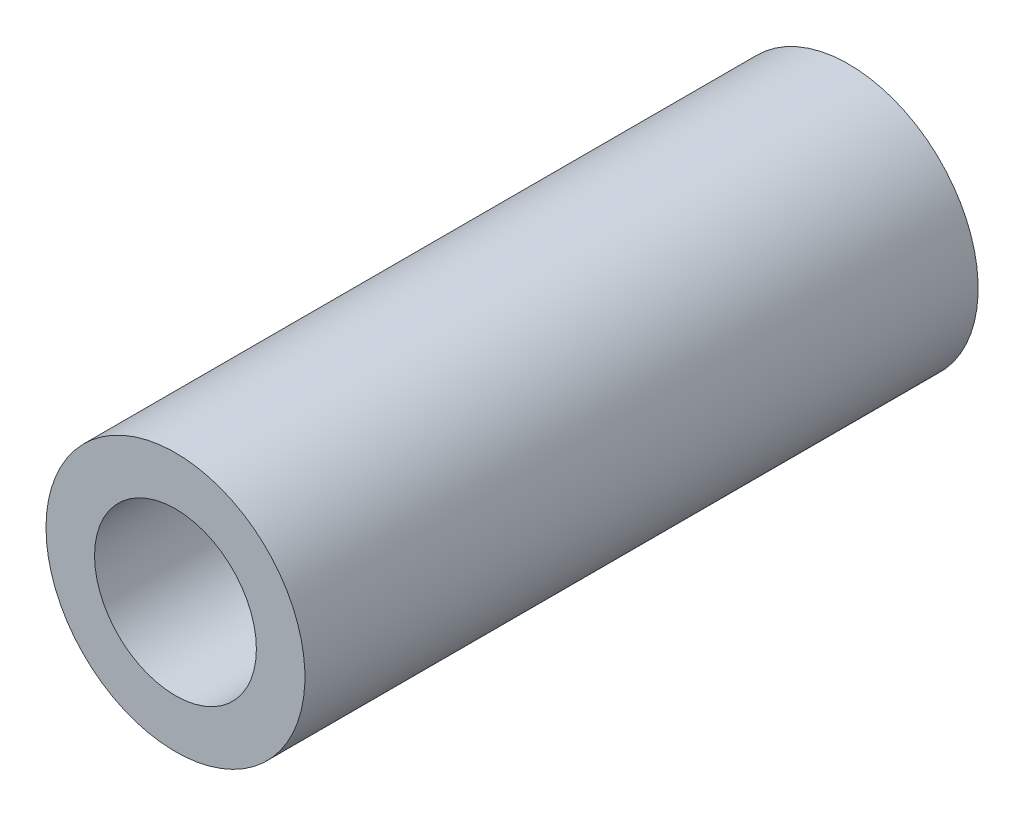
ISO-10303-21;
HEADER;
FILE_DESCRIPTION(('STEP AP214'),'2;1');
FILE_NAME('part.step','',(''),(''),'','','');
FILE_SCHEMA(('AUTOMOTIVE_DESIGN { 1 0 10303 214 1 1 1 1 }'));
ENDSEC;
DATA;
#1=APPLICATION_CONTEXT('core data for automotive mechanical design processes');
#2=APPLICATION_PROTOCOL_DEFINITION('international standard','automotive_design',2000,#1);
#3=PRODUCT_CONTEXT('',#1,'mechanical');
#4=PRODUCT('Part','Part','',(#3));
#5=PRODUCT_RELATED_PRODUCT_CATEGORY('part','',(#4));
#6=PRODUCT_DEFINITION_FORMATION('','',#4);
#7=PRODUCT_DEFINITION_CONTEXT('part definition',#1,'design');
#8=PRODUCT_DEFINITION('design','',#6,#7);
#9=PRODUCT_DEFINITION_SHAPE('','',#8);
#10=(LENGTH_UNIT() NAMED_UNIT(*) SI_UNIT(.MILLI.,.METRE.));
#11=(NAMED_UNIT(*) PLANE_ANGLE_UNIT() SI_UNIT($,.RADIAN.));
#12=(NAMED_UNIT(*) SI_UNIT($,.STERADIAN.) SOLID_ANGLE_UNIT());
#13=UNCERTAINTY_MEASURE_WITH_UNIT(LENGTH_MEASURE(1.E-05),#10,'distance_accuracy_value','');
#14=(GEOMETRIC_REPRESENTATION_CONTEXT(3) GLOBAL_UNCERTAINTY_ASSIGNED_CONTEXT((#13)) GLOBAL_UNIT_ASSIGNED_CONTEXT((#10,
#11,#12)) REPRESENTATION_CONTEXT('',''));
#15=CARTESIAN_POINT('',(0.,0.,0.));
#16=DIRECTION('',(0.,0.,1.));
#17=DIRECTION('',(1.,0.,0.));
#18=AXIS2_PLACEMENT_3D('',#15,#16,#17);
#19=CARTESIAN_POINT('',(0.,0.,13.208));
#20=DIRECTION('',(0.,0.,1.));
#21=DIRECTION('',(1.,0.,0.));
#22=AXIS2_PLACEMENT_3D('',#19,#20,#21);
#23=PLANE('',#22);
#24=CARTESIAN_POINT('',(0.,0.,13.208));
#25=DIRECTION('',(0.,0.,1.));
#26=DIRECTION('',(1.,0.,0.));
#27=AXIS2_PLACEMENT_3D('',#24,#25,#26);
#28=CIRCLE('',#27,2.54);
#29=CARTESIAN_POINT('',(-2.54,0.,13.208));
#30=VERTEX_POINT('',#29);
#31=EDGE_CURVE('E10',#30,#30,#28,.T.);
#32=ORIENTED_EDGE('',*,*,#31,.T.);
#33=EDGE_LOOP('',(#32));
#34=FACE_BOUND('',#33,.T.);
#35=CARTESIAN_POINT('',(0.,0.,13.208));
#36=DIRECTION('',(0.,0.,1.));
#37=DIRECTION('',(1.,0.,0.));
#38=AXIS2_PLACEMENT_3D('',#35,#36,#37);
#39=CIRCLE('',#38,1.5875);
#40=CARTESIAN_POINT('',(-1.5875,0.,13.208));
#41=VERTEX_POINT('',#40);
#42=EDGE_CURVE('E41',#41,#41,#39,.T.);
#43=ORIENTED_EDGE('',*,*,#42,.F.);
#44=EDGE_LOOP('',(#43));
#45=FACE_BOUND('',#44,.T.);
#46=ADVANCED_FACE('F30',(#34,#45),#23,.T.);
#47=CARTESIAN_POINT('',(0.,0.,0.));
#48=DIRECTION('',(0.,0.,1.));
#49=DIRECTION('',(1.,0.,0.));
#50=AXIS2_PLACEMENT_3D('',#47,#48,#49);
#51=PLANE('',#50);
#52=CARTESIAN_POINT('',(0.,0.,0.));
#53=DIRECTION('',(0.,0.,1.));
#54=DIRECTION('',(1.,0.,0.));
#55=AXIS2_PLACEMENT_3D('',#52,#53,#54);
#56=CIRCLE('',#55,2.54);
#57=CARTESIAN_POINT('',(-2.54,0.,0.));
#58=VERTEX_POINT('',#57);
#59=EDGE_CURVE('E37',#58,#58,#56,.T.);
#60=ORIENTED_EDGE('',*,*,#59,.F.);
#61=EDGE_LOOP('',(#60));
#62=FACE_BOUND('',#61,.T.);
#63=CARTESIAN_POINT('',(0.,0.,0.));
#64=DIRECTION('',(0.,0.,1.));
#65=DIRECTION('',(1.,0.,0.));
#66=AXIS2_PLACEMENT_3D('',#63,#64,#65);
#67=CIRCLE('',#66,1.5875);
#68=CARTESIAN_POINT('',(-1.5875,0.,0.));
#69=VERTEX_POINT('',#68);
#70=EDGE_CURVE('E45',#69,#69,#67,.T.);
#71=ORIENTED_EDGE('',*,*,#70,.T.);
#72=EDGE_LOOP('',(#71));
#73=FACE_BOUND('',#72,.T.);
#74=ADVANCED_FACE('F51',(#62,#73),#51,.F.);
#75=CARTESIAN_POINT('',(0.,0.,13.208));
#76=DIRECTION('',(0.,0.,-1.));
#77=DIRECTION('',(-1.,0.,0.));
#78=AXIS2_PLACEMENT_3D('',#75,#76,#77);
#79=CYLINDRICAL_SURFACE('',#78,2.54);
#80=CARTESIAN_POINT('',(-2.54,0.,13.208));
#81=CARTESIAN_POINT('',(-2.54,0.,13.0704166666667));
#82=CARTESIAN_POINT('',(-2.54,0.,12.9328333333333));
#83=CARTESIAN_POINT('',(-2.54,0.,12.6576666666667));
#84=CARTESIAN_POINT('',(-2.54,0.,12.5200833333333));
#85=CARTESIAN_POINT('',(-2.54,0.,12.2449166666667));
#86=CARTESIAN_POINT('',(-2.54,0.,12.1073333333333));
#87=CARTESIAN_POINT('',(-2.54,0.,11.8321666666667));
#88=CARTESIAN_POINT('',(-2.54,0.,11.6945833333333));
#89=CARTESIAN_POINT('',(-2.54,0.,11.4194166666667));
#90=CARTESIAN_POINT('',(-2.54,0.,11.2818333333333));
#91=CARTESIAN_POINT('',(-2.54,0.,11.0066666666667));
#92=CARTESIAN_POINT('',(-2.54,0.,10.8690833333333));
#93=CARTESIAN_POINT('',(-2.54,0.,10.5939166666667));
#94=CARTESIAN_POINT('',(-2.54,0.,10.4563333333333));
#95=CARTESIAN_POINT('',(-2.54,0.,10.1811666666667));
#96=CARTESIAN_POINT('',(-2.54,0.,10.0435833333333));
#97=CARTESIAN_POINT('',(-2.54,0.,9.76841666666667));
#98=CARTESIAN_POINT('',(-2.54,0.,9.63083333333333));
#99=CARTESIAN_POINT('',(-2.54,0.,9.35566666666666));
#100=CARTESIAN_POINT('',(-2.54,0.,9.21808333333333));
#101=CARTESIAN_POINT('',(-2.54,0.,8.94291666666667));
#102=CARTESIAN_POINT('',(-2.54,0.,8.80533333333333));
#103=CARTESIAN_POINT('',(-2.54,0.,8.53016666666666));
#104=CARTESIAN_POINT('',(-2.54,0.,8.39258333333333));
#105=CARTESIAN_POINT('',(-2.54,0.,8.11741666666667));
#106=CARTESIAN_POINT('',(-2.54,0.,7.97983333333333));
#107=CARTESIAN_POINT('',(-2.54,0.,7.70466666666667));
#108=CARTESIAN_POINT('',(-2.54,0.,7.56708333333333));
#109=CARTESIAN_POINT('',(-2.54,0.,7.29191666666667));
#110=CARTESIAN_POINT('',(-2.54,0.,7.15433333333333));
#111=CARTESIAN_POINT('',(-2.54,0.,6.87916666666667));
#112=CARTESIAN_POINT('',(-2.54,0.,6.74158333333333));
#113=CARTESIAN_POINT('',(-2.54,0.,6.46641666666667));
#114=CARTESIAN_POINT('',(-2.54,0.,6.32883333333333));
#115=CARTESIAN_POINT('',(-2.54,0.,6.05366666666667));
#116=CARTESIAN_POINT('',(-2.54,0.,5.91608333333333));
#117=CARTESIAN_POINT('',(-2.54,0.,5.64091666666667));
#118=CARTESIAN_POINT('',(-2.54,0.,5.50333333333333));
#119=CARTESIAN_POINT('',(-2.54,0.,5.22816666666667));
#120=CARTESIAN_POINT('',(-2.54,0.,5.09058333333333));
#121=CARTESIAN_POINT('',(-2.54,0.,4.81541666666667));
#122=CARTESIAN_POINT('',(-2.54,0.,4.67783333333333));
#123=CARTESIAN_POINT('',(-2.54,0.,4.40266666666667));
#124=CARTESIAN_POINT('',(-2.54,0.,4.26508333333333));
#125=CARTESIAN_POINT('',(-2.54,0.,3.98991666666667));
#126=CARTESIAN_POINT('',(-2.54,0.,3.85233333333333));
#127=CARTESIAN_POINT('',(-2.54,0.,3.57716666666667));
#128=CARTESIAN_POINT('',(-2.54,0.,3.43958333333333));
#129=CARTESIAN_POINT('',(-2.54,0.,3.16441666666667));
#130=CARTESIAN_POINT('',(-2.54,0.,3.02683333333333));
#131=CARTESIAN_POINT('',(-2.54,0.,2.75166666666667));
#132=CARTESIAN_POINT('',(-2.54,0.,2.61408333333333));
#133=CARTESIAN_POINT('',(-2.54,0.,2.33891666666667));
#134=CARTESIAN_POINT('',(-2.54,0.,2.20133333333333));
#135=CARTESIAN_POINT('',(-2.54,0.,1.92616666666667));
#136=CARTESIAN_POINT('',(-2.54,0.,1.78858333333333));
#137=CARTESIAN_POINT('',(-2.54,0.,1.51341666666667));
#138=CARTESIAN_POINT('',(-2.54,0.,1.37583333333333));
#139=CARTESIAN_POINT('',(-2.54,0.,1.10066666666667));
#140=CARTESIAN_POINT('',(-2.54,0.,0.963083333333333));
#141=CARTESIAN_POINT('',(-2.54,0.,0.687916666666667));
#142=CARTESIAN_POINT('',(-2.54,0.,0.550333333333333));
#143=CARTESIAN_POINT('',(-2.54,0.,0.275166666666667));
#144=CARTESIAN_POINT('',(-2.54,0.,0.137583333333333));
#145=CARTESIAN_POINT('',(-2.54,0.,0.));
#146=B_SPLINE_CURVE_WITH_KNOTS('',3,(#80,#81,#82,#83,#84,#85,#86,#87,#88,#89,#90,#91,#92,#93,
#94,#95,#96,#97,#98,#99,#100,#101,#102,#103,#104,#105,#106,#107,#108,#109,#110,#111,#112,#113,
#114,#115,#116,#117,#118,#119,#120,#121,#122,#123,#124,#125,#126,#127,#128,#129,#130,#131,#132,
#133,#134,#135,#136,#137,#138,#139,#140,#141,#142,#143,#144,#145),.UNSPECIFIED.,.F.,.F.,(4,2,2,
2,2,2,2,2,2,2,2,2,2,2,2,2,2,2,2,2,2,2,2,2,2,2,2,2,2,2,2,2,4),(0.,0.412750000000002,
0.825500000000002,1.23825,1.651,2.06375,2.4765,2.88925,3.302,3.71475,4.1275,4.54025,4.953,
5.36575,5.7785,6.19125,6.604,7.01675,7.4295,7.84225,8.255,8.66775,9.0805,9.49325,9.906,10.31875,
10.7315,11.14425,11.557,11.96975,12.3825,12.79525,13.208),.UNSPECIFIED.);
#147=EDGE_CURVE('BSEAM32',#30,#58,#146,.T.);
#148=ORIENTED_EDGE('',*,*,#31,.F.);
#149=ORIENTED_EDGE('',*,*,#59,.T.);
#150=ORIENTED_EDGE('',*,*,#147,.T.);
#151=ORIENTED_EDGE('',*,*,#147,.F.);
#152=EDGE_LOOP('',(#148,#150,#149,#151));
#153=FACE_BOUND('',#152,.T.);
#154=ADVANCED_FACE('F32',(#153),#79,.T.);
#155=CARTESIAN_POINT('',(0.,0.,13.208));
#156=DIRECTION('',(0.,0.,-1.));
#157=DIRECTION('',(-1.,0.,0.));
#158=AXIS2_PLACEMENT_3D('',#155,#156,#157);
#159=CYLINDRICAL_SURFACE('',#158,1.5875);
#160=CARTESIAN_POINT('',(-1.5875,0.,13.208));
#161=CARTESIAN_POINT('',(-1.5875,0.,13.0704166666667));
#162=CARTESIAN_POINT('',(-1.5875,0.,12.9328333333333));
#163=CARTESIAN_POINT('',(-1.5875,0.,12.6576666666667));
#164=CARTESIAN_POINT('',(-1.5875,0.,12.5200833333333));
#165=CARTESIAN_POINT('',(-1.5875,0.,12.2449166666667));
#166=CARTESIAN_POINT('',(-1.5875,0.,12.1073333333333));
#167=CARTESIAN_POINT('',(-1.5875,0.,11.8321666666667));
#168=CARTESIAN_POINT('',(-1.5875,0.,11.6945833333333));
#169=CARTESIAN_POINT('',(-1.5875,0.,11.4194166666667));
#170=CARTESIAN_POINT('',(-1.5875,0.,11.2818333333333));
#171=CARTESIAN_POINT('',(-1.5875,0.,11.0066666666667));
#172=CARTESIAN_POINT('',(-1.5875,0.,10.8690833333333));
#173=CARTESIAN_POINT('',(-1.5875,0.,10.5939166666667));
#174=CARTESIAN_POINT('',(-1.5875,0.,10.4563333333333));
#175=CARTESIAN_POINT('',(-1.5875,0.,10.1811666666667));
#176=CARTESIAN_POINT('',(-1.5875,0.,10.0435833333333));
#177=CARTESIAN_POINT('',(-1.5875,0.,9.76841666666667));
#178=CARTESIAN_POINT('',(-1.5875,0.,9.63083333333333));
#179=CARTESIAN_POINT('',(-1.5875,0.,9.35566666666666));
#180=CARTESIAN_POINT('',(-1.5875,0.,9.21808333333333));
#181=CARTESIAN_POINT('',(-1.5875,0.,8.94291666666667));
#182=CARTESIAN_POINT('',(-1.5875,0.,8.80533333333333));
#183=CARTESIAN_POINT('',(-1.5875,0.,8.53016666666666));
#184=CARTESIAN_POINT('',(-1.5875,0.,8.39258333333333));
#185=CARTESIAN_POINT('',(-1.5875,0.,8.11741666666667));
#186=CARTESIAN_POINT('',(-1.5875,0.,7.97983333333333));
#187=CARTESIAN_POINT('',(-1.5875,0.,7.70466666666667));
#188=CARTESIAN_POINT('',(-1.5875,0.,7.56708333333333));
#189=CARTESIAN_POINT('',(-1.5875,0.,7.29191666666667));
#190=CARTESIAN_POINT('',(-1.5875,0.,7.15433333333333));
#191=CARTESIAN_POINT('',(-1.5875,0.,6.87916666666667));
#192=CARTESIAN_POINT('',(-1.5875,0.,6.74158333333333));
#193=CARTESIAN_POINT('',(-1.5875,0.,6.46641666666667));
#194=CARTESIAN_POINT('',(-1.5875,0.,6.32883333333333));
#195=CARTESIAN_POINT('',(-1.5875,0.,6.05366666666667));
#196=CARTESIAN_POINT('',(-1.5875,0.,5.91608333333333));
#197=CARTESIAN_POINT('',(-1.5875,0.,5.64091666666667));
#198=CARTESIAN_POINT('',(-1.5875,0.,5.50333333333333));
#199=CARTESIAN_POINT('',(-1.5875,0.,5.22816666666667));
#200=CARTESIAN_POINT('',(-1.5875,0.,5.09058333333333));
#201=CARTESIAN_POINT('',(-1.5875,0.,4.81541666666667));
#202=CARTESIAN_POINT('',(-1.5875,0.,4.67783333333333));
#203=CARTESIAN_POINT('',(-1.5875,0.,4.40266666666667));
#204=CARTESIAN_POINT('',(-1.5875,0.,4.26508333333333));
#205=CARTESIAN_POINT('',(-1.5875,0.,3.98991666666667));
#206=CARTESIAN_POINT('',(-1.5875,0.,3.85233333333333));
#207=CARTESIAN_POINT('',(-1.5875,0.,3.57716666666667));
#208=CARTESIAN_POINT('',(-1.5875,0.,3.43958333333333));
#209=CARTESIAN_POINT('',(-1.5875,0.,3.16441666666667));
#210=CARTESIAN_POINT('',(-1.5875,0.,3.02683333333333));
#211=CARTESIAN_POINT('',(-1.5875,0.,2.75166666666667));
#212=CARTESIAN_POINT('',(-1.5875,0.,2.61408333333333));
#213=CARTESIAN_POINT('',(-1.5875,0.,2.33891666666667));
#214=CARTESIAN_POINT('',(-1.5875,0.,2.20133333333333));
#215=CARTESIAN_POINT('',(-1.5875,0.,1.92616666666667));
#216=CARTESIAN_POINT('',(-1.5875,0.,1.78858333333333));
#217=CARTESIAN_POINT('',(-1.5875,0.,1.51341666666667));
#218=CARTESIAN_POINT('',(-1.5875,0.,1.37583333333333));
#219=CARTESIAN_POINT('',(-1.5875,0.,1.10066666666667));
#220=CARTESIAN_POINT('',(-1.5875,0.,0.963083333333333));
#221=CARTESIAN_POINT('',(-1.5875,0.,0.687916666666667));
#222=CARTESIAN_POINT('',(-1.5875,0.,0.550333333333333));
#223=CARTESIAN_POINT('',(-1.5875,0.,0.275166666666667));
#224=CARTESIAN_POINT('',(-1.5875,0.,0.137583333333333));
#225=CARTESIAN_POINT('',(-1.5875,0.,0.));
#226=B_SPLINE_CURVE_WITH_KNOTS('',3,(#160,#161,#162,#163,#164,#165,#166,#167,#168,#169,#170,
#171,#172,#173,#174,#175,#176,#177,#178,#179,#180,#181,#182,#183,#184,#185,#186,#187,#188,#189,
#190,#191,#192,#193,#194,#195,#196,#197,#198,#199,#200,#201,#202,#203,#204,#205,#206,#207,#208,
#209,#210,#211,#212,#213,#214,#215,#216,#217,#218,#219,#220,#221,#222,#223,#224,#225),
.UNSPECIFIED.,.F.,.F.,(4,2,2,2,2,2,2,2,2,2,2,2,2,2,2,2,2,2,2,2,2,2,2,2,2,2,2,2,2,2,2,2,4),(0.,
0.412750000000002,0.825500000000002,1.23825,1.651,2.06375,2.4765,2.88925,3.302,3.71475,4.1275,
4.54025,4.953,5.36575,5.7785,6.19125,6.604,7.01675,7.4295,7.84225,8.255,8.66775,9.0805,9.49325,
9.906,10.31875,10.7315,11.14425,11.557,11.96975,12.3825,12.79525,13.208),.UNSPECIFIED.);
#227=EDGE_CURVE('BSEAM53',#41,#69,#226,.T.);
#228=ORIENTED_EDGE('',*,*,#42,.T.);
#229=ORIENTED_EDGE('',*,*,#70,.F.);
#230=ORIENTED_EDGE('',*,*,#227,.T.);
#231=ORIENTED_EDGE('',*,*,#227,.F.);
#232=EDGE_LOOP('',(#228,#230,#229,#231));
#233=FACE_BOUND('',#232,.T.);
#234=ADVANCED_FACE('F53',(#233),#159,.F.);
#235=CLOSED_SHELL('',(#46,#74,#154,#234));
#236=MANIFOLD_SOLID_BREP('B2',#235);
#237=ADVANCED_BREP_SHAPE_REPRESENTATION('',(#18,#236),#14);
#238=SHAPE_DEFINITION_REPRESENTATION(#9,#237);
ENDSEC;
END-ISO-10303-21;
